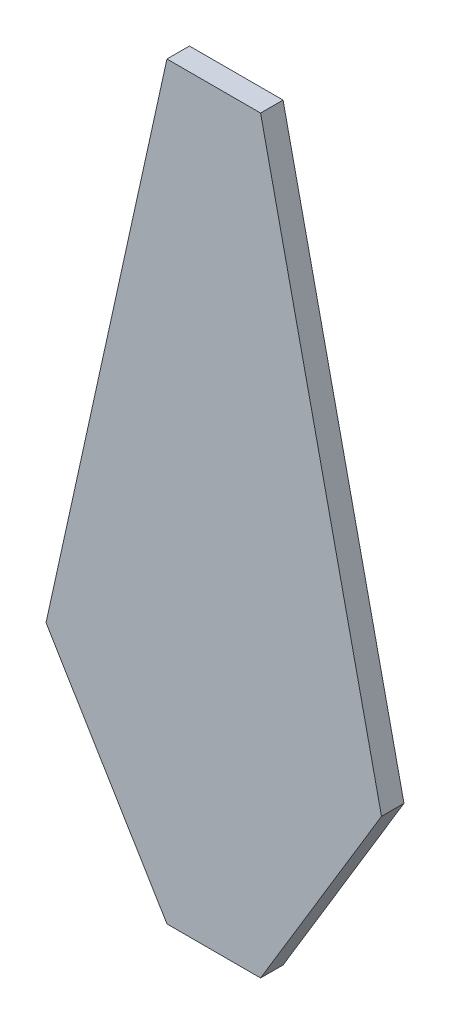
from build123d import *

# Parameters (mm, degrees)
BOSS_EXTRU_1_DEPTH      = 18
ESQUISSE2_W             = 55
ESQUISSE2_H             = 450
ENL_V_MAT_EXTRU_2_DEPTH = 10
ESQUISSE3_W             = 65
ESQUISSE3_H             = 460
ENL_V_MAT_EXTRU_4_DEPTH = 3
ESQUISSE7_W             = 16.5
ESQUISSE7_H             = 26.5
ENL_V_MAT_EXTRU_5_DEPTH = 10


with BuildPart() as part:
    # Esquisse1 → Boss.-Extru.1 (new body)
    with BuildSketch(Plane.XY):
        Polygon((37.5, 0), (-37.5, 0), (-134.355309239, -439.453125), (-37.5, -600), (37.5, -600), (134.355309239, -439.453125), align=None)
    extrude(amount=BOSS_EXTRU_1_DEPTH)

    # Esquisse2 → Enl_v. mat.-Extru.2 (cut)
    with BuildSketch(Plane(origin=(0, 0, 0), x_dir=(-1, 0, 0), z_dir=(0, 0, -1))):
        with Locations((0, -330)):
            Rectangle(ESQUISSE2_W, ESQUISSE2_H)
    extrude(amount=-ENL_V_MAT_EXTRU_2_DEPTH, mode=Mode.SUBTRACT)

    # Esquisse3 → Enl_v. mat.-Extru.4 (cut)
    with BuildSketch(Plane(origin=(0, 0, 0), x_dir=(-1, 0, 0), z_dir=(0, 0, -1))):
        with Locations((-0.182477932, -330)):
            Rectangle(ESQUISSE3_W, ESQUISSE3_H)
    extrude(amount=-ENL_V_MAT_EXTRU_4_DEPTH, mode=Mode.SUBTRACT)

    # Esquisse7 → Enl_v. mat.-Extru.5 (cut)
    with BuildSketch(Plane(origin=(0, 0, 0), x_dir=(-1, 0, 0), z_dir=(0, 0, -1))):
        with Locations((0, -28.25)):
            Rectangle(ESQUISSE7_W, ESQUISSE7_H)
    extrude(amount=-ENL_V_MAT_EXTRU_5_DEPTH, mode=Mode.SUBTRACT)


solid = part.part
